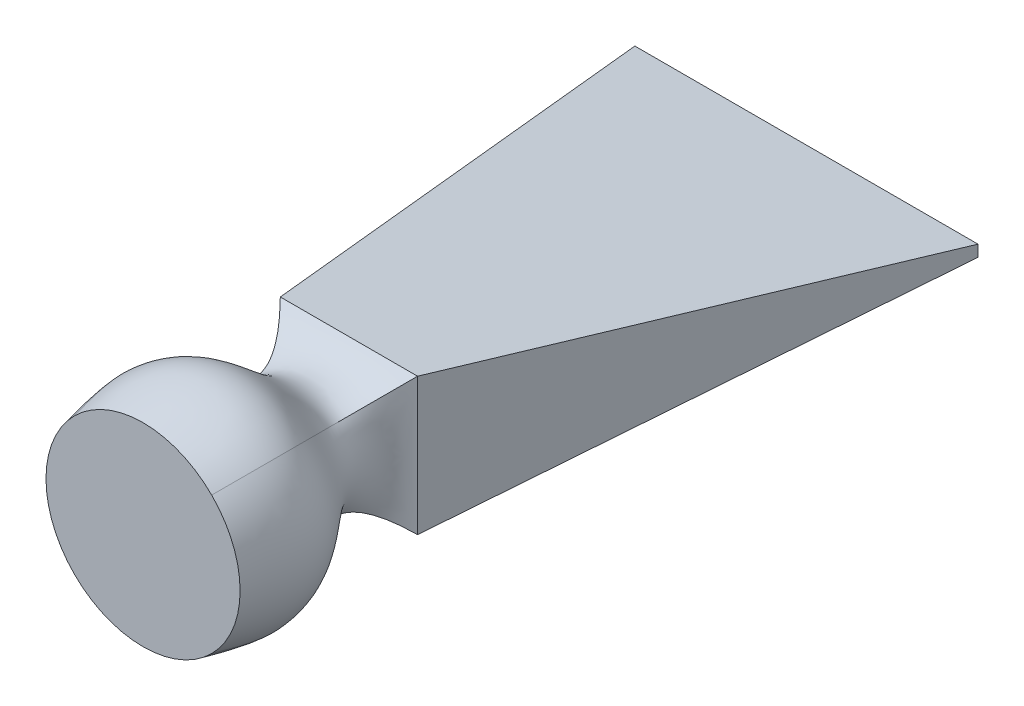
ISO-10303-21;
HEADER;
FILE_DESCRIPTION(('STEP AP214'),'2;1');
FILE_NAME('part.step','',(''),(''),'','','');
FILE_SCHEMA(('AUTOMOTIVE_DESIGN { 1 0 10303 214 1 1 1 1 }'));
ENDSEC;
DATA;
#1=APPLICATION_CONTEXT('core data for automotive mechanical design processes');
#2=APPLICATION_PROTOCOL_DEFINITION('international standard','automotive_design',2000,#1);
#3=PRODUCT_CONTEXT('',#1,'mechanical');
#4=PRODUCT('Part','Part','',(#3));
#5=PRODUCT_RELATED_PRODUCT_CATEGORY('part','',(#4));
#6=PRODUCT_DEFINITION_FORMATION('','',#4);
#7=PRODUCT_DEFINITION_CONTEXT('part definition',#1,'design');
#8=PRODUCT_DEFINITION('design','',#6,#7);
#9=PRODUCT_DEFINITION_SHAPE('','',#8);
#10=(LENGTH_UNIT() NAMED_UNIT(*) SI_UNIT(.MILLI.,.METRE.));
#11=(NAMED_UNIT(*) PLANE_ANGLE_UNIT() SI_UNIT($,.RADIAN.));
#12=(NAMED_UNIT(*) SI_UNIT($,.STERADIAN.) SOLID_ANGLE_UNIT());
#13=UNCERTAINTY_MEASURE_WITH_UNIT(LENGTH_MEASURE(1.E-05),#10,'distance_accuracy_value','');
#14=(GEOMETRIC_REPRESENTATION_CONTEXT(3) GLOBAL_UNCERTAINTY_ASSIGNED_CONTEXT((#13)) GLOBAL_UNIT_ASSIGNED_CONTEXT((#10,
#11,#12)) REPRESENTATION_CONTEXT('',''));
#15=CARTESIAN_POINT('',(0.,0.,0.));
#16=DIRECTION('',(0.,0.,1.));
#17=DIRECTION('',(1.,0.,0.));
#18=AXIS2_PLACEMENT_3D('',#15,#16,#17);
#19=CARTESIAN_POINT('',(-8.6468430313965E-05,-5.34597789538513E-05,6.71354067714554));
#20=DIRECTION('',(0.,0.,1.));
#21=DIRECTION('',(1.,0.,0.));
#22=AXIS2_PLACEMENT_3D('',#19,#20,#21);
#23=PLANE('',#22);
#24=CARTESIAN_POINT('',(-8.6468430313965E-05,-5.34597789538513E-05,6.71354067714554));
#25=DIRECTION('',(0.,0.,1.));
#26=DIRECTION('',(1.,0.,0.));
#27=AXIS2_PLACEMENT_3D('',#24,#25,#26);
#28=CIRCLE('',#27,12.7279220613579);
#29=CARTESIAN_POINT('',(-9.00008646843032,-9.00005345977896,6.71354067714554));
#30=VERTEX_POINT('',#29);
#31=CARTESIAN_POINT('',(8.99991353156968,-9.00005345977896,6.71354067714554));
#32=VERTEX_POINT('',#31);
#33=EDGE_CURVE('E12',#30,#32,#28,.T.);
#34=ORIENTED_EDGE('',*,*,#33,.T.);
#35=CARTESIAN_POINT('',(8.99991353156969,8.99994654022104,6.71354067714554));
#36=VERTEX_POINT('',#35);
#37=EDGE_CURVE('E86',#32,#36,#28,.T.);
#38=ORIENTED_EDGE('',*,*,#37,.T.);
#39=CARTESIAN_POINT('',(-9.00008646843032,8.99994654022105,6.71354067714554));
#40=VERTEX_POINT('',#39);
#41=EDGE_CURVE('E296',#36,#40,#28,.T.);
#42=ORIENTED_EDGE('',*,*,#41,.T.);
#43=EDGE_CURVE('E225',#40,#30,#28,.T.);
#44=ORIENTED_EDGE('',*,*,#43,.T.);
#45=EDGE_LOOP('',(#34,#38,#42,#44));
#46=FACE_BOUND('',#45,.T.);
#47=ADVANCED_FACE('F76',(#46),#23,.T.);
#48=CARTESIAN_POINT('',(8.99991353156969,-9.00005345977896,-20.2864593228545));
#49=CARTESIAN_POINT('',(6.53544743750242,-6.53558736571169,-17.7864593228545));
#50=CARTESIAN_POINT('',(3.43433731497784,-3.43447724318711,-12.2811818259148));
#51=CARTESIAN_POINT('',(10.9762352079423,-10.9763751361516,-4.99943518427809));
#52=CARTESIAN_POINT('',(9.70736165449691,-9.70750158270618,2.44531269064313));
#53=CARTESIAN_POINT('',(8.99991353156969,-9.00005345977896,6.71354067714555));
#54=CARTESIAN_POINT('',(8.99991353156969,-3.00005345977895,-20.2864593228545));
#55=CARTESIAN_POINT('',(6.53544743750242,-2.17856476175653,-17.7864593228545));
#56=CARTESIAN_POINT('',(7.1190121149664,-1.91096220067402,-12.2811818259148));
#57=CARTESIAN_POINT('',(16.4512430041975,-4.79716605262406,-4.99943518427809));
#58=CARTESIAN_POINT('',(14.6745967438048,-4.2686344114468,2.44531269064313));
#59=CARTESIAN_POINT('',(13.9671486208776,-4.03281837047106,6.71354067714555));
#60=CARTESIAN_POINT('',(8.99991353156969,2.99994654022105,-20.2864593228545));
#61=CARTESIAN_POINT('',(6.53544743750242,2.17845784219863,-17.7864593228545));
#62=CARTESIAN_POINT('',(7.11901211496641,1.91085528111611,-12.2811818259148));
#63=CARTESIAN_POINT('',(16.4512430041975,4.79705913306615,-4.99943518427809));
#64=CARTESIAN_POINT('',(14.6745967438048,4.26852749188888,2.44531269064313));
#65=CARTESIAN_POINT('',(13.9671486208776,4.03271145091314,6.71354067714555));
#66=CARTESIAN_POINT('',(8.99991353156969,8.99994654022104,-20.2864593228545));
#67=CARTESIAN_POINT('',(6.53544743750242,6.53548044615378,-17.7864593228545));
#68=CARTESIAN_POINT('',(3.43433731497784,3.4343703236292,-12.2811818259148));
#69=CARTESIAN_POINT('',(10.9762352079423,10.9762682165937,-4.99943518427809));
#70=CARTESIAN_POINT('',(9.70736165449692,9.70739466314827,2.44531269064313));
#71=CARTESIAN_POINT('',(8.99991353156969,8.99994654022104,6.71354067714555));
#72=B_SPLINE_SURFACE_WITH_KNOTS('',3,3,((#48,#49,#50,#51,#52,#53),(#54,#55,#56,#57,#58,#59),
(#60,#61,#62,#63,#64,#65),(#66,#67,#68,#69,#70,#71)),.UNSPECIFIED.,.F.,.F.,.F.,(4,4),(4,1,1,4),
(0.,1.),(0.,0.284226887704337,0.593739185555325,1.),.UNSPECIFIED.);
#73=DIRECTION('',(0.,1.,0.));
#74=VECTOR('',#73,1.);
#75=CARTESIAN_POINT('',(8.99991353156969,8.99994654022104,-20.2864593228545));
#76=LINE('',#75,#74);
#77=CARTESIAN_POINT('',(8.99991353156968,-9.00005345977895,-20.2864593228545));
#78=VERTEX_POINT('',#77);
#79=CARTESIAN_POINT('',(8.99991353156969,8.99994654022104,-20.2864593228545));
#80=VERTEX_POINT('',#79);
#81=EDGE_CURVE('E136',#78,#80,#76,.T.);
#82=CARTESIAN_POINT('',(8.99991353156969,8.99994654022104,-20.2864593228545));
#83=CARTESIAN_POINT('',(6.53544743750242,6.53548044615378,-17.7864593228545));
#84=CARTESIAN_POINT('',(3.43433731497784,3.4343703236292,-12.2811818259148));
#85=CARTESIAN_POINT('',(10.9762352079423,10.9762682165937,-4.99943518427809));
#86=CARTESIAN_POINT('',(9.70736165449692,9.70739466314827,2.44531269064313));
#87=CARTESIAN_POINT('',(8.99991353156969,8.99994654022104,6.71354067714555));
#88=B_SPLINE_CURVE_WITH_KNOTS('',3,(#82,#83,#84,#85,#86,#87),.UNSPECIFIED.,.F.,.F.,(4,1,1,4),
(0.,0.284226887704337,0.593739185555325,1.),.UNSPECIFIED.);
#89=EDGE_CURVE('E197',#80,#36,#88,.T.);
#90=CARTESIAN_POINT('',(8.99991353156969,-9.00005345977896,-20.2864593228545));
#91=CARTESIAN_POINT('',(6.53544743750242,-6.53558736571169,-17.7864593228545));
#92=CARTESIAN_POINT('',(3.43433731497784,-3.43447724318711,-12.2811818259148));
#93=CARTESIAN_POINT('',(10.9762352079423,-10.9763751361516,-4.99943518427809));
#94=CARTESIAN_POINT('',(9.70736165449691,-9.70750158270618,2.44531269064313));
#95=CARTESIAN_POINT('',(8.99991353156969,-9.00005345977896,6.71354067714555));
#96=B_SPLINE_CURVE_WITH_KNOTS('',3,(#90,#91,#92,#93,#94,#95),.UNSPECIFIED.,.F.,.F.,(4,1,1,4),
(0.,0.284226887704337,0.593739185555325,1.),.UNSPECIFIED.);
#97=EDGE_CURVE('E206',#32,#78,#96,.F.);
#98=ORIENTED_EDGE('',*,*,#81,.T.);
#99=ORIENTED_EDGE('',*,*,#89,.T.);
#100=ORIENTED_EDGE('',*,*,#37,.F.);
#101=ORIENTED_EDGE('',*,*,#97,.T.);
#102=EDGE_LOOP('',(#98,#99,#100,#101));
#103=FACE_BOUND('',#102,.T.);
#104=ADVANCED_FACE('F374',(#103),#72,.T.);
#105=CARTESIAN_POINT('',(8.99991353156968,8.99994654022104,-20.2864593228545));
#106=CARTESIAN_POINT('',(6.53544743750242,6.53548044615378,-17.7864593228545));
#107=CARTESIAN_POINT('',(3.43433731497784,3.4343703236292,-12.2811818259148));
#108=CARTESIAN_POINT('',(10.9762352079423,10.9762682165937,-4.99943518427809));
#109=CARTESIAN_POINT('',(9.70736165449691,9.70739466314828,2.44531269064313));
#110=CARTESIAN_POINT('',(8.99991353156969,8.99994654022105,6.71354067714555));
#111=CARTESIAN_POINT('',(2.99991353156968,8.99994654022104,-20.2864593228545));
#112=CARTESIAN_POINT('',(2.17842483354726,6.53548044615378,-17.7864593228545));
#113=CARTESIAN_POINT('',(1.91082227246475,7.11904512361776,-12.2811818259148));
#114=CARTESIAN_POINT('',(4.79702612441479,16.4512760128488,-4.99943518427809));
#115=CARTESIAN_POINT('',(4.26849448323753,14.6746297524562,2.44531269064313));
#116=CARTESIAN_POINT('',(4.03267844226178,13.967181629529,6.71354067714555));
#117=CARTESIAN_POINT('',(-3.00008646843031,8.99994654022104,-20.2864593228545));
#118=CARTESIAN_POINT('',(-2.17859777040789,6.53548044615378,-17.7864593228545));
#119=CARTESIAN_POINT('',(-1.91099520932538,7.11904512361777,-12.2811818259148));
#120=CARTESIAN_POINT('',(-4.79719906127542,16.4512760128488,-4.99943518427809));
#121=CARTESIAN_POINT('',(-4.26866742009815,14.6746297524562,2.44531269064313));
#122=CARTESIAN_POINT('',(-4.03285137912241,13.9671816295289,6.71354067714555));
#123=CARTESIAN_POINT('',(-9.00008646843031,8.99994654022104,-20.2864593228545));
#124=CARTESIAN_POINT('',(-6.53562037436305,6.53548044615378,-17.7864593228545));
#125=CARTESIAN_POINT('',(-3.43451025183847,3.4343703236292,-12.2811818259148));
#126=CARTESIAN_POINT('',(-10.976408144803,10.9762682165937,-4.99943518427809));
#127=CARTESIAN_POINT('',(-9.70753459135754,9.70739466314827,2.44531269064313));
#128=CARTESIAN_POINT('',(-9.00008646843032,8.99994654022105,6.71354067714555));
#129=B_SPLINE_SURFACE_WITH_KNOTS('',3,3,((#105,#106,#107,#108,#109,#110),(#111,#112,#113,#114,
#115,#116),(#117,#118,#119,#120,#121,#122),(#123,#124,#125,#126,#127,#128)),.UNSPECIFIED.,.F.,
.F.,.F.,(4,4),(4,1,1,4),(0.,1.),(0.,0.284226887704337,0.593739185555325,1.),.UNSPECIFIED.);
#130=DIRECTION('',(-1.,0.,0.));
#131=VECTOR('',#130,1.);
#132=CARTESIAN_POINT('',(-9.00008646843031,8.99994654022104,-20.2864593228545));
#133=LINE('',#132,#131);
#134=CARTESIAN_POINT('',(-9.00008646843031,8.99994654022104,-20.2864593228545));
#135=VERTEX_POINT('',#134);
#136=EDGE_CURVE('E235',#80,#135,#133,.T.);
#137=CARTESIAN_POINT('',(-9.00008646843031,8.99994654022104,-20.2864593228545));
#138=CARTESIAN_POINT('',(-6.53562037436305,6.53548044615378,-17.7864593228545));
#139=CARTESIAN_POINT('',(-3.43451025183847,3.4343703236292,-12.2811818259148));
#140=CARTESIAN_POINT('',(-10.976408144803,10.9762682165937,-4.99943518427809));
#141=CARTESIAN_POINT('',(-9.70753459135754,9.70739466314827,2.44531269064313));
#142=CARTESIAN_POINT('',(-9.00008646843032,8.99994654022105,6.71354067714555));
#143=B_SPLINE_CURVE_WITH_KNOTS('',3,(#137,#138,#139,#140,#141,#142),.UNSPECIFIED.,.F.,.F.,(4,1,
1,4),(0.,0.284226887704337,0.593739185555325,1.),.UNSPECIFIED.);
#144=EDGE_CURVE('E205',#135,#40,#143,.T.);
#145=ORIENTED_EDGE('',*,*,#136,.T.);
#146=ORIENTED_EDGE('',*,*,#144,.T.);
#147=ORIENTED_EDGE('',*,*,#41,.F.);
#148=ORIENTED_EDGE('',*,*,#89,.F.);
#149=EDGE_LOOP('',(#145,#146,#147,#148));
#150=FACE_BOUND('',#149,.T.);
#151=ADVANCED_FACE('F272',(#150),#129,.T.);
#152=CARTESIAN_POINT('',(-9.00008646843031,-9.00005345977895,-20.2864593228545));
#153=CARTESIAN_POINT('',(-6.53562037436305,-6.53558736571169,-17.7864593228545));
#154=CARTESIAN_POINT('',(-3.43451025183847,-3.43447724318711,-12.2811818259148));
#155=CARTESIAN_POINT('',(-10.976408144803,-10.9763751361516,-4.99943518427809));
#156=CARTESIAN_POINT('',(-9.70753459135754,-9.70750158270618,2.44531269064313));
#157=CARTESIAN_POINT('',(-9.00008646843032,-9.00005345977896,6.71354067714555));
#158=CARTESIAN_POINT('',(-3.00008646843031,-9.00005345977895,-20.2864593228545));
#159=CARTESIAN_POINT('',(-2.17859777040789,-6.53558736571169,-17.7864593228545));
#160=CARTESIAN_POINT('',(-1.91099520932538,-7.11915204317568,-12.2811818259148));
#161=CARTESIAN_POINT('',(-4.79719906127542,-16.4513829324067,-4.99943518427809));
#162=CARTESIAN_POINT('',(-4.26866742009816,-14.6747366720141,2.44531269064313));
#163=CARTESIAN_POINT('',(-4.03285137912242,-13.9672885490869,6.71354067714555));
#164=CARTESIAN_POINT('',(2.99991353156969,-9.00005345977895,-20.2864593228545));
#165=CARTESIAN_POINT('',(2.17842483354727,-6.53558736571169,-17.7864593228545));
#166=CARTESIAN_POINT('',(1.91082227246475,-7.11915204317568,-12.2811818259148));
#167=CARTESIAN_POINT('',(4.79702612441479,-16.4513829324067,-4.99943518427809));
#168=CARTESIAN_POINT('',(4.26849448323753,-14.6747366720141,2.44531269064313));
#169=CARTESIAN_POINT('',(4.03267844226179,-13.9672885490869,6.71354067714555));
#170=CARTESIAN_POINT('',(8.99991353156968,-9.00005345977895,-20.2864593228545));
#171=CARTESIAN_POINT('',(6.53544743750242,-6.53558736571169,-17.7864593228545));
#172=CARTESIAN_POINT('',(3.43433731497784,-3.43447724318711,-12.2811818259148));
#173=CARTESIAN_POINT('',(10.9762352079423,-10.9763751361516,-4.99943518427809));
#174=CARTESIAN_POINT('',(9.70736165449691,-9.70750158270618,2.44531269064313));
#175=CARTESIAN_POINT('',(8.99991353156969,-9.00005345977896,6.71354067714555));
#176=B_SPLINE_SURFACE_WITH_KNOTS('',3,3,((#152,#153,#154,#155,#156,#157),(#158,#159,#160,#161,
#162,#163),(#164,#165,#166,#167,#168,#169),(#170,#171,#172,#173,#174,#175)),.UNSPECIFIED.,.F.,
.F.,.F.,(4,4),(4,1,1,4),(0.,1.),(0.,0.284226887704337,0.593739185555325,1.),.UNSPECIFIED.);
#177=DIRECTION('',(1.,0.,0.));
#178=VECTOR('',#177,1.);
#179=CARTESIAN_POINT('',(-9.00008646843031,-9.00005345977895,-20.2864593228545));
#180=LINE('',#179,#178);
#181=CARTESIAN_POINT('',(-9.00008646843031,-9.00005345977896,-20.2864593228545));
#182=VERTEX_POINT('',#181);
#183=EDGE_CURVE('E330',#182,#78,#180,.T.);
#184=CARTESIAN_POINT('',(-9.00008646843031,-9.00005345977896,-20.2864593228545));
#185=CARTESIAN_POINT('',(-6.53562037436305,-6.53558736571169,-17.7864593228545));
#186=CARTESIAN_POINT('',(-3.43451025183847,-3.43447724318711,-12.2811818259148));
#187=CARTESIAN_POINT('',(-10.976408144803,-10.9763751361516,-4.99943518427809));
#188=CARTESIAN_POINT('',(-9.70753459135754,-9.70750158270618,2.44531269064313));
#189=CARTESIAN_POINT('',(-9.00008646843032,-9.00005345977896,6.71354067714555));
#190=B_SPLINE_CURVE_WITH_KNOTS('',3,(#184,#185,#186,#187,#188,#189),.UNSPECIFIED.,.F.,.F.,(4,1,
1,4),(0.,0.284226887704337,0.593739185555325,1.),.UNSPECIFIED.);
#191=EDGE_CURVE('E216',#182,#30,#190,.T.);
#192=ORIENTED_EDGE('',*,*,#183,.T.);
#193=ORIENTED_EDGE('',*,*,#97,.F.);
#194=ORIENTED_EDGE('',*,*,#33,.F.);
#195=ORIENTED_EDGE('',*,*,#191,.F.);
#196=EDGE_LOOP('',(#192,#193,#194,#195));
#197=FACE_BOUND('',#196,.T.);
#198=ADVANCED_FACE('F261',(#197),#176,.T.);
#199=CARTESIAN_POINT('',(-9.00008646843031,8.99994654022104,-20.2864593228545));
#200=CARTESIAN_POINT('',(-6.53562037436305,6.53548044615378,-17.7864593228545));
#201=CARTESIAN_POINT('',(-3.43451025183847,3.4343703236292,-12.2811818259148));
#202=CARTESIAN_POINT('',(-10.976408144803,10.9762682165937,-4.99943518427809));
#203=CARTESIAN_POINT('',(-9.70753459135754,9.70739466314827,2.44531269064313));
#204=CARTESIAN_POINT('',(-9.00008646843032,8.99994654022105,6.71354067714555));
#205=CARTESIAN_POINT('',(-9.00008646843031,2.99994654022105,-20.2864593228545));
#206=CARTESIAN_POINT('',(-6.53562037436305,2.17845784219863,-17.7864593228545));
#207=CARTESIAN_POINT('',(-7.11918505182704,1.91085528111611,-12.2811818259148));
#208=CARTESIAN_POINT('',(-16.4514159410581,4.79705913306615,-4.99943518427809));
#209=CARTESIAN_POINT('',(-14.6747696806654,4.26852749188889,2.44531269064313));
#210=CARTESIAN_POINT('',(-13.9673215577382,4.03271145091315,6.71354067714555));
#211=CARTESIAN_POINT('',(-9.00008646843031,-3.00005345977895,-20.2864593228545));
#212=CARTESIAN_POINT('',(-6.53562037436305,-2.17856476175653,-17.7864593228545));
#213=CARTESIAN_POINT('',(-7.11918505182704,-1.91096220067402,-12.2811818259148));
#214=CARTESIAN_POINT('',(-16.4514159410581,-4.79716605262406,-4.99943518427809));
#215=CARTESIAN_POINT('',(-14.6747696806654,-4.2686344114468,2.44531269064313));
#216=CARTESIAN_POINT('',(-13.9673215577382,-4.03281837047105,6.71354067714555));
#217=CARTESIAN_POINT('',(-9.00008646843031,-9.00005345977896,-20.2864593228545));
#218=CARTESIAN_POINT('',(-6.53562037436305,-6.53558736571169,-17.7864593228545));
#219=CARTESIAN_POINT('',(-3.43451025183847,-3.43447724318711,-12.2811818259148));
#220=CARTESIAN_POINT('',(-10.976408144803,-10.9763751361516,-4.99943518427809));
#221=CARTESIAN_POINT('',(-9.70753459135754,-9.70750158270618,2.44531269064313));
#222=CARTESIAN_POINT('',(-9.00008646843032,-9.00005345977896,6.71354067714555));
#223=B_SPLINE_SURFACE_WITH_KNOTS('',3,3,((#199,#200,#201,#202,#203,#204),(#205,#206,#207,#208,
#209,#210),(#211,#212,#213,#214,#215,#216),(#217,#218,#219,#220,#221,#222)),.UNSPECIFIED.,.F.,
.F.,.F.,(4,4),(4,1,1,4),(0.,1.),(0.,0.284226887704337,0.593739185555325,1.),.UNSPECIFIED.);
#224=DIRECTION('',(0.,-1.,0.));
#225=VECTOR('',#224,1.);
#226=CARTESIAN_POINT('',(-9.00008646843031,8.99994654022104,-20.2864593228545));
#227=LINE('',#226,#225);
#228=EDGE_CURVE('E337',#135,#182,#227,.T.);
#229=ORIENTED_EDGE('',*,*,#228,.T.);
#230=ORIENTED_EDGE('',*,*,#191,.T.);
#231=ORIENTED_EDGE('',*,*,#43,.F.);
#232=ORIENTED_EDGE('',*,*,#144,.F.);
#233=EDGE_LOOP('',(#229,#230,#231,#232));
#234=FACE_BOUND('',#233,.T.);
#235=ADVANCED_FACE('F175',(#234),#223,.T.);
#236=CARTESIAN_POINT('',(-8.6468430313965E-05,-5.34597789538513E-05,-80.2864593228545));
#237=DIRECTION('',(0.,0.,1.));
#238=DIRECTION('',(1.,0.,0.));
#239=AXIS2_PLACEMENT_3D('',#236,#237,#238);
#240=PLANE('',#239);
#241=DIRECTION('',(0.,-1.,0.));
#242=VECTOR('',#241,1.);
#243=CARTESIAN_POINT('',(-22.5000864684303,-0.750053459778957,-80.2864593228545));
#244=LINE('',#243,#242);
#245=CARTESIAN_POINT('',(-22.5000864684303,0.749946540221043,-80.2864593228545));
#246=VERTEX_POINT('',#245);
#247=CARTESIAN_POINT('',(-22.5000864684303,-0.750053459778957,-80.2864593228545));
#248=VERTEX_POINT('',#247);
#249=EDGE_CURVE('E193',#246,#248,#244,.T.);
#250=ORIENTED_EDGE('',*,*,#249,.F.);
#251=DIRECTION('',(-1.,0.,0.));
#252=VECTOR('',#251,1.);
#253=CARTESIAN_POINT('',(22.4999135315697,0.749946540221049,-80.2864593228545));
#254=LINE('',#253,#252);
#255=CARTESIAN_POINT('',(22.4999135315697,0.749946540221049,-80.2864593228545));
#256=VERTEX_POINT('',#255);
#257=EDGE_CURVE('E155',#256,#246,#254,.T.);
#258=ORIENTED_EDGE('',*,*,#257,.F.);
#259=DIRECTION('',(0.,1.,0.));
#260=VECTOR('',#259,1.);
#261=CARTESIAN_POINT('',(22.4999135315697,-0.750053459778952,-80.2864593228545));
#262=LINE('',#261,#260);
#263=CARTESIAN_POINT('',(22.4999135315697,-0.750053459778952,-80.2864593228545));
#264=VERTEX_POINT('',#263);
#265=EDGE_CURVE('E80',#264,#256,#262,.T.);
#266=ORIENTED_EDGE('',*,*,#265,.F.);
#267=DIRECTION('',(1.,0.,0.));
#268=VECTOR('',#267,1.);
#269=CARTESIAN_POINT('',(22.4999135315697,-0.750053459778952,-80.2864593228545));
#270=LINE('',#269,#268);
#271=EDGE_CURVE('E142',#248,#264,#270,.T.);
#272=ORIENTED_EDGE('',*,*,#271,.F.);
#273=EDGE_LOOP('',(#250,#258,#266,#272));
#274=FACE_BOUND('',#273,.T.);
#275=ADVANCED_FACE('F154',(#274),#240,.F.);
#276=CARTESIAN_POINT('',(-8.6468430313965E-05,8.83294761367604,-21.5009969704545));
#277=DIRECTION('',(0.,-0.990678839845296,0.136218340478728));
#278=DIRECTION('',(0.,-0.136218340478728,-0.990678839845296));
#279=AXIS2_PLACEMENT_3D('',#276,#277,#278);
#280=PLANE('',#279);
#281=DIRECTION('',(0.217563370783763,0.132955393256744,0.966948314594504));
#282=VECTOR('',#281,1.);
#283=CARTESIAN_POINT('',(-22.5000864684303,0.749946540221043,-80.2864593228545));
#284=LINE('',#283,#282);
#285=EDGE_CURVE('E150',#246,#135,#284,.T.);
#286=ORIENTED_EDGE('',*,*,#285,.T.);
#287=ORIENTED_EDGE('',*,*,#136,.F.);
#288=DIRECTION('',(-0.217563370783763,0.132955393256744,0.966948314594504));
#289=VECTOR('',#288,1.);
#290=CARTESIAN_POINT('',(22.4999135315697,0.749946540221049,-80.2864593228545));
#291=LINE('',#290,#289);
#292=EDGE_CURVE('E387',#256,#80,#291,.T.);
#293=ORIENTED_EDGE('',*,*,#292,.F.);
#294=ORIENTED_EDGE('',*,*,#257,.T.);
#295=EDGE_LOOP('',(#286,#287,#293,#294));
#296=FACE_BOUND('',#295,.T.);
#297=ADVANCED_FACE('F174',(#296),#280,.F.);
#298=CARTESIAN_POINT('',(8.56624309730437,-5.34597789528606E-05,-18.3590351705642));
#299=DIRECTION('',(-0.975609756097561,0.,-0.219512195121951));
#300=DIRECTION('',(-0.219512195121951,0.,0.975609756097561));
#301=AXIS2_PLACEMENT_3D('',#298,#299,#300);
#302=PLANE('',#301);
#303=ORIENTED_EDGE('',*,*,#292,.T.);
#304=ORIENTED_EDGE('',*,*,#81,.F.);
#305=DIRECTION('',(-0.217563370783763,-0.132955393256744,0.966948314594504));
#306=VECTOR('',#305,1.);
#307=CARTESIAN_POINT('',(22.4999135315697,-0.750053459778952,-80.2864593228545));
#308=LINE('',#307,#306);
#309=EDGE_CURVE('E129',#264,#78,#308,.T.);
#310=ORIENTED_EDGE('',*,*,#309,.F.);
#311=ORIENTED_EDGE('',*,*,#265,.T.);
#312=EDGE_LOOP('',(#303,#304,#310,#311));
#313=FACE_BOUND('',#312,.T.);
#314=ADVANCED_FACE('F131',(#313),#302,.F.);
#315=CARTESIAN_POINT('',(-8.56641603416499,-5.3459778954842E-05,-18.3590351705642));
#316=DIRECTION('',(0.975609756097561,0.,-0.219512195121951));
#317=DIRECTION('',(-0.219512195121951,0.,-0.975609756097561));
#318=AXIS2_PLACEMENT_3D('',#315,#316,#317);
#319=PLANE('',#318);
#320=DIRECTION('',(0.217563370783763,-0.132955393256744,0.966948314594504));
#321=VECTOR('',#320,1.);
#322=CARTESIAN_POINT('',(-22.5000864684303,-0.750053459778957,-80.2864593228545));
#323=LINE('',#322,#321);
#324=EDGE_CURVE('E139',#248,#182,#323,.T.);
#325=ORIENTED_EDGE('',*,*,#324,.T.);
#326=ORIENTED_EDGE('',*,*,#228,.F.);
#327=ORIENTED_EDGE('',*,*,#285,.F.);
#328=ORIENTED_EDGE('',*,*,#249,.T.);
#329=EDGE_LOOP('',(#325,#326,#327,#328));
#330=FACE_BOUND('',#329,.T.);
#331=ADVANCED_FACE('F361',(#330),#319,.F.);
#332=CARTESIAN_POINT('',(-8.6468430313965E-05,-8.83305453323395,-21.5009969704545));
#333=DIRECTION('',(0.,0.990678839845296,0.136218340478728));
#334=DIRECTION('',(0.,-0.136218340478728,0.990678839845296));
#335=AXIS2_PLACEMENT_3D('',#332,#333,#334);
#336=PLANE('',#335);
#337=ORIENTED_EDGE('',*,*,#309,.T.);
#338=ORIENTED_EDGE('',*,*,#183,.F.);
#339=ORIENTED_EDGE('',*,*,#324,.F.);
#340=ORIENTED_EDGE('',*,*,#271,.T.);
#341=EDGE_LOOP('',(#337,#338,#339,#340));
#342=FACE_BOUND('',#341,.T.);
#343=ADVANCED_FACE('F144',(#342),#336,.F.);
#344=CLOSED_SHELL('',(#47,#104,#151,#198,#235,#275,#297,#314,#331,#343));
#345=MANIFOLD_SOLID_BREP('B2',#344);
#346=ADVANCED_BREP_SHAPE_REPRESENTATION('',(#18,#345),#14);
#347=SHAPE_DEFINITION_REPRESENTATION(#9,#346);
ENDSEC;
END-ISO-10303-21;
